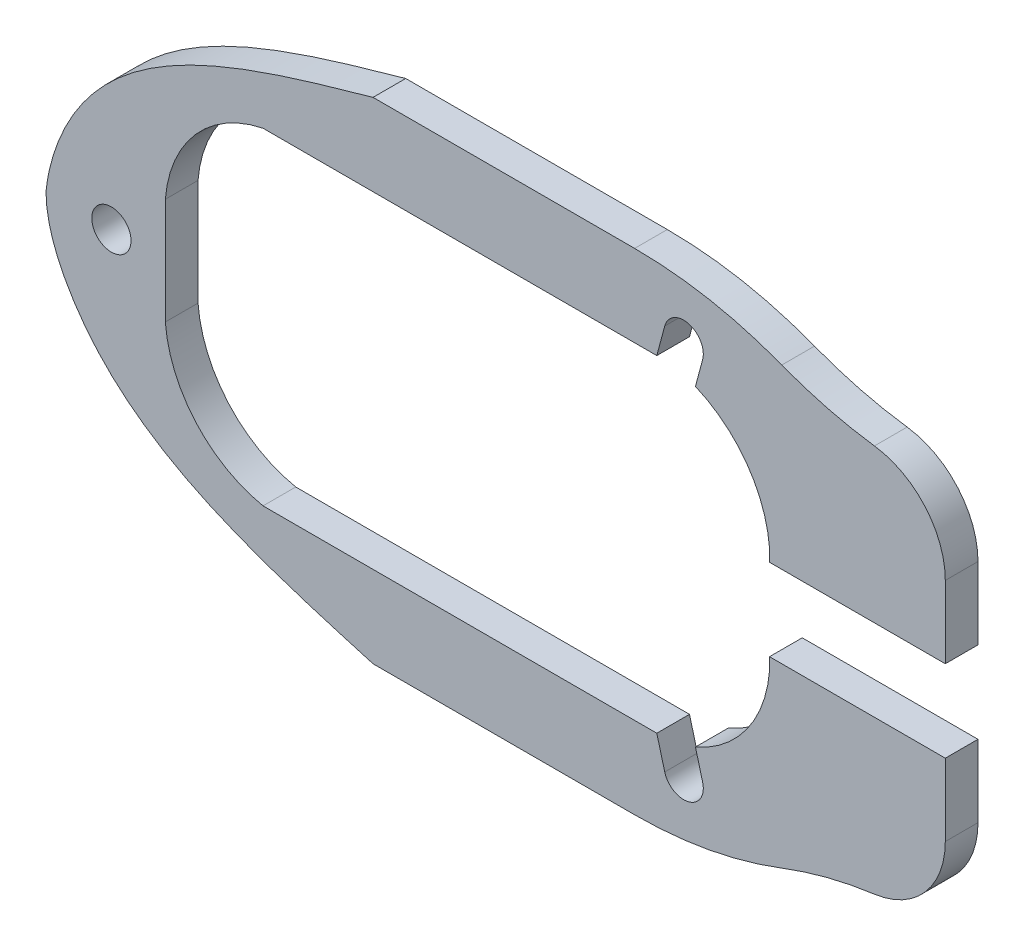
ISO-10303-21;
HEADER;
FILE_DESCRIPTION(('STEP AP214'),'2;1');
FILE_NAME('part.step','',(''),(''),'','','');
FILE_SCHEMA(('AUTOMOTIVE_DESIGN { 1 0 10303 214 1 1 1 1 }'));
ENDSEC;
DATA;
#1=APPLICATION_CONTEXT('core data for automotive mechanical design processes');
#2=APPLICATION_PROTOCOL_DEFINITION('international standard','automotive_design',2000,#1);
#3=PRODUCT_CONTEXT('',#1,'mechanical');
#4=PRODUCT('Part','Part','',(#3));
#5=PRODUCT_RELATED_PRODUCT_CATEGORY('part','',(#4));
#6=PRODUCT_DEFINITION_FORMATION('','',#4);
#7=PRODUCT_DEFINITION_CONTEXT('part definition',#1,'design');
#8=PRODUCT_DEFINITION('design','',#6,#7);
#9=PRODUCT_DEFINITION_SHAPE('','',#8);
#10=(LENGTH_UNIT() NAMED_UNIT(*) SI_UNIT(.MILLI.,.METRE.));
#11=(NAMED_UNIT(*) PLANE_ANGLE_UNIT() SI_UNIT($,.RADIAN.));
#12=(NAMED_UNIT(*) SI_UNIT($,.STERADIAN.) SOLID_ANGLE_UNIT());
#13=UNCERTAINTY_MEASURE_WITH_UNIT(LENGTH_MEASURE(1.E-05),#10,'distance_accuracy_value','');
#14=(GEOMETRIC_REPRESENTATION_CONTEXT(3) GLOBAL_UNCERTAINTY_ASSIGNED_CONTEXT((#13)) GLOBAL_UNIT_ASSIGNED_CONTEXT((#10,
#11,#12)) REPRESENTATION_CONTEXT('',''));
#15=CARTESIAN_POINT('',(0.,0.,0.));
#16=DIRECTION('',(0.,0.,1.));
#17=DIRECTION('',(1.,0.,0.));
#18=AXIS2_PLACEMENT_3D('',#15,#16,#17);
#19=CARTESIAN_POINT('',(-144.117623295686,19.4455310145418,2.));
#20=DIRECTION('',(0.,0.,-1.));
#21=DIRECTION('',(-1.,0.,0.));
#22=AXIS2_PLACEMENT_3D('',#19,#20,#21);
#23=PLANE('',#22);
#24=CARTESIAN_POINT('',(-190.117623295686,26.3610086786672,2.));
#25=DIRECTION('',(0.,0.,1.));
#26=DIRECTION('',(1.,0.,0.));
#27=AXIS2_PLACEMENT_3D('',#24,#25,#26);
#28=CIRCLE('',#27,1.20000000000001);
#29=CARTESIAN_POINT('',(-188.917623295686,26.3610086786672,2.));
#30=VERTEX_POINT('',#29);
#31=EDGE_CURVE('E263',#30,#30,#28,.T.);
#32=ORIENTED_EDGE('',*,*,#31,.F.);
#33=EDGE_LOOP('',(#32));
#34=FACE_BOUND('',#33,.T.);
#35=DIRECTION('',(0.258819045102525,-0.965925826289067,0.));
#36=VECTOR('',#35,1.);
#37=CARTESIAN_POINT('',(-156.276734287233,14.5504258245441,2.));
#38=LINE('',#37,#36);
#39=CARTESIAN_POINT('',(-156.761878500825,16.3610086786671,2.));
#40=VERTEX_POINT('',#39);
#41=CARTESIAN_POINT('',(-156.276734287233,14.5504258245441,2.));
#42=VERTEX_POINT('',#41);
#43=EDGE_CURVE('E226',#40,#42,#38,.T.);
#44=ORIENTED_EDGE('',*,*,#43,.F.);
#45=DIRECTION('',(1.,0.,0.));
#46=VECTOR('',#45,1.);
#47=CARTESIAN_POINT('',(-180.843707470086,16.3610086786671,2.));
#48=LINE('',#47,#46);
#49=CARTESIAN_POINT('',(-180.843707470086,16.3610086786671,2.));
#50=VERTEX_POINT('',#49);
#51=EDGE_CURVE('E269',#50,#40,#48,.T.);
#52=ORIENTED_EDGE('',*,*,#51,.F.);
#53=CARTESIAN_POINT('',(-179.343707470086,23.7094779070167,2.));
#54=DIRECTION('',(0.,0.,1.));
#55=DIRECTION('',(1.,0.,0.));
#56=AXIS2_PLACEMENT_3D('',#53,#54,#55);
#57=CIRCLE('',#56,7.50000000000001);
#58=CARTESIAN_POINT('',(-186.819791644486,23.1110086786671,2.));
#59=VERTEX_POINT('',#58);
#60=EDGE_CURVE('E266',#59,#50,#57,.T.);
#61=ORIENTED_EDGE('',*,*,#60,.F.);
#62=DIRECTION('',(0.,-1.,0.));
#63=VECTOR('',#62,1.);
#64=CARTESIAN_POINT('',(-186.819791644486,29.6110086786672,2.));
#65=LINE('',#64,#63);
#66=CARTESIAN_POINT('',(-186.819791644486,29.6110086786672,2.));
#67=VERTEX_POINT('',#66);
#68=EDGE_CURVE('E293',#67,#59,#65,.T.);
#69=ORIENTED_EDGE('',*,*,#68,.F.);
#70=CARTESIAN_POINT('',(-179.343707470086,29.0125394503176,2.));
#71=DIRECTION('',(0.,0.,1.));
#72=DIRECTION('',(-1.,0.,0.));
#73=AXIS2_PLACEMENT_3D('',#70,#71,#72);
#74=CIRCLE('',#73,7.50000000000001);
#75=CARTESIAN_POINT('',(-180.843707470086,36.3610086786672,2.));
#76=VERTEX_POINT('',#75);
#77=EDGE_CURVE('E290',#76,#67,#74,.T.);
#78=ORIENTED_EDGE('',*,*,#77,.F.);
#79=DIRECTION('',(-1.,0.,0.));
#80=VECTOR('',#79,1.);
#81=CARTESIAN_POINT('',(-180.843707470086,36.3610086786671,2.));
#82=LINE('',#81,#80);
#83=CARTESIAN_POINT('',(-156.761878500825,36.3610086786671,2.));
#84=VERTEX_POINT('',#83);
#85=EDGE_CURVE('E288',#84,#76,#82,.T.);
#86=ORIENTED_EDGE('',*,*,#85,.F.);
#87=DIRECTION('',(-0.258819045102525,-0.965925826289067,0.));
#88=VECTOR('',#87,1.);
#89=CARTESIAN_POINT('',(-156.276734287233,38.1715915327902,2.));
#90=LINE('',#89,#88);
#91=CARTESIAN_POINT('',(-156.276734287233,38.1715915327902,2.));
#92=VERTEX_POINT('',#91);
#93=EDGE_CURVE('E251',#92,#84,#90,.T.);
#94=ORIENTED_EDGE('',*,*,#93,.F.);
#95=CARTESIAN_POINT('',(-155.117623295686,37.8610086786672,2.));
#96=DIRECTION('',(0.,0.,1.));
#97=DIRECTION('',(1.,0.,0.));
#98=AXIS2_PLACEMENT_3D('',#95,#96,#97);
#99=CIRCLE('',#98,1.20000000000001);
#100=CARTESIAN_POINT('',(-153.958512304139,37.5504258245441,2.));
#101=VERTEX_POINT('',#100);
#102=EDGE_CURVE('E249',#101,#92,#99,.T.);
#103=ORIENTED_EDGE('',*,*,#102,.F.);
#104=DIRECTION('',(0.258819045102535,0.965925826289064,0.));
#105=VECTOR('',#104,1.);
#106=CARTESIAN_POINT('',(-154.769987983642,34.5219573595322,2.));
#107=LINE('',#106,#105);
#108=CARTESIAN_POINT('',(-154.39809415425,35.9098840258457,2.));
#109=VERTEX_POINT('',#108);
#110=EDGE_CURVE('E253',#109,#101,#107,.T.);
#111=ORIENTED_EDGE('',*,*,#110,.F.);
#112=CARTESIAN_POINT('',(-157.343707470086,29.0125394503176,2.));
#113=DIRECTION('',(0.,0.,1.));
#114=DIRECTION('',(-1.,0.,0.));
#115=AXIS2_PLACEMENT_3D('',#112,#113,#114);
#116=CIRCLE('',#115,7.49999999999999);
#117=CARTESIAN_POINT('',(-149.867623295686,29.6110086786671,2.));
#118=VERTEX_POINT('',#117);
#119=EDGE_CURVE('E285',#118,#109,#116,.T.);
#120=ORIENTED_EDGE('',*,*,#119,.F.);
#121=DIRECTION('',(0.,1.,0.));
#122=VECTOR('',#121,1.);
#123=CARTESIAN_POINT('',(-149.867623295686,29.6110086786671,2.));
#124=LINE('',#123,#122);
#125=CARTESIAN_POINT('',(-149.867623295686,28.8610086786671,2.));
#126=VERTEX_POINT('',#125);
#127=EDGE_CURVE('E282',#126,#118,#124,.T.);
#128=ORIENTED_EDGE('',*,*,#127,.F.);
#129=DIRECTION('',(-1.,0.,0.));
#130=VECTOR('',#129,1.);
#131=CARTESIAN_POINT('',(-149.867623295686,28.8610086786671,2.));
#132=LINE('',#131,#130);
#133=CARTESIAN_POINT('',(-139.117623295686,28.8610086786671,2.));
#134=VERTEX_POINT('',#133);
#135=EDGE_CURVE('E279',#134,#126,#132,.T.);
#136=ORIENTED_EDGE('',*,*,#135,.F.);
#137=DIRECTION('',(0.,1.,0.));
#138=VECTOR('',#137,1.);
#139=CARTESIAN_POINT('',(-139.117623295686,33.2764863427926,2.));
#140=LINE('',#139,#138);
#141=CARTESIAN_POINT('',(-139.117623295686,33.2764863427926,2.));
#142=VERTEX_POINT('',#141);
#143=EDGE_CURVE('E385',#134,#142,#140,.T.);
#144=ORIENTED_EDGE('',*,*,#143,.T.);
#145=CARTESIAN_POINT('',(-144.117623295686,33.2764863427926,2.));
#146=DIRECTION('',(0.,0.,1.));
#147=DIRECTION('',(-1.,0.,0.));
#148=AXIS2_PLACEMENT_3D('',#145,#146,#147);
#149=CIRCLE('',#148,5.);
#150=CARTESIAN_POINT('',(-143.450956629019,38.2318425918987,2.));
#151=VERTEX_POINT('',#150);
#152=EDGE_CURVE('E389',#142,#151,#149,.T.);
#153=ORIENTED_EDGE('',*,*,#152,.T.);
#154=CARTESIAN_POINT('',(-140.117623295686,63.0086238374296,2.));
#155=DIRECTION('',(0.,0.,-1.));
#156=DIRECTION('',(-1.,0.,0.));
#157=AXIS2_PLACEMENT_3D('',#154,#155,#156);
#158=CIRCLE('',#157,25.);
#159=CARTESIAN_POINT('',(-149.117623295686,39.6848162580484,2.));
#160=VERTEX_POINT('',#159);
#161=EDGE_CURVE('E391',#151,#160,#158,.T.);
#162=ORIENTED_EDGE('',*,*,#161,.T.);
#163=CARTESIAN_POINT('',(-158.117623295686,16.3610086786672,2.));
#164=DIRECTION('',(0.,0.,1.));
#165=DIRECTION('',(1.,0.,0.));
#166=AXIS2_PLACEMENT_3D('',#163,#164,#165);
#167=CIRCLE('',#166,25.);
#168=CARTESIAN_POINT('',(-158.117623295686,41.3610086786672,2.));
#169=VERTEX_POINT('',#168);
#170=EDGE_CURVE('E393',#160,#169,#167,.T.);
#171=ORIENTED_EDGE('',*,*,#170,.T.);
#172=DIRECTION('',(-1.,0.,0.));
#173=VECTOR('',#172,1.);
#174=CARTESIAN_POINT('',(-174.117623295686,41.3610086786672,2.));
#175=LINE('',#174,#173);
#176=CARTESIAN_POINT('',(-174.117623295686,41.3610086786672,2.));
#177=VERTEX_POINT('',#176);
#178=EDGE_CURVE('E395',#169,#177,#175,.T.);
#179=ORIENTED_EDGE('',*,*,#178,.T.);
#180=CARTESIAN_POINT('',(-174.117623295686,41.3610086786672,2.));
#181=CARTESIAN_POINT('',(-181.70516900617,39.2157054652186,2.));
#182=CARTESIAN_POINT('',(-190.998119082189,36.588216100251,2.));
#183=CARTESIAN_POINT('',(-193.959232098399,27.9475153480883,2.));
#184=CARTESIAN_POINT('',(-194.117623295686,26.3610086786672,2.));
#185=B_SPLINE_CURVE_WITH_KNOTS('',3,(#180,#181,#182,#183,#184),.UNSPECIFIED.,.F.,.F.,(4,1,4),
(0.,0.816484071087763,1.),.UNSPECIFIED.);
#186=CARTESIAN_POINT('',(-194.117623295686,26.3610086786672,2.));
#187=VERTEX_POINT('',#186);
#188=EDGE_CURVE('E397',#177,#187,#185,.T.);
#189=ORIENTED_EDGE('',*,*,#188,.T.);
#190=CARTESIAN_POINT('',(-194.117623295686,26.3610086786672,2.));
#191=CARTESIAN_POINT('',(-194.117623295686,24.7666150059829,2.));
#192=CARTESIAN_POINT('',(-190.662711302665,16.1505027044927,2.));
#193=CARTESIAN_POINT('',(-181.554407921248,13.513818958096,2.));
#194=CARTESIAN_POINT('',(-174.117623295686,11.3610086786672,2.));
#195=B_SPLINE_CURVE_WITH_KNOTS('',3,(#190,#191,#192,#193,#194),.UNSPECIFIED.,.F.,.F.,(4,1,4),
(0.,0.183515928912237,1.),.UNSPECIFIED.);
#196=CARTESIAN_POINT('',(-174.117623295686,11.3610086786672,2.));
#197=VERTEX_POINT('',#196);
#198=EDGE_CURVE('E402',#187,#197,#195,.T.);
#199=ORIENTED_EDGE('',*,*,#198,.T.);
#200=DIRECTION('',(1.,0.,0.));
#201=VECTOR('',#200,1.);
#202=CARTESIAN_POINT('',(-174.117623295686,11.3610086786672,2.));
#203=LINE('',#202,#201);
#204=CARTESIAN_POINT('',(-158.117623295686,11.3610086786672,2.));
#205=VERTEX_POINT('',#204);
#206=EDGE_CURVE('E590',#197,#205,#203,.T.);
#207=ORIENTED_EDGE('',*,*,#206,.T.);
#208=CARTESIAN_POINT('',(-158.117623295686,36.3610086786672,2.));
#209=DIRECTION('',(0.,0.,1.));
#210=DIRECTION('',(-1.,0.,0.));
#211=AXIS2_PLACEMENT_3D('',#208,#209,#210);
#212=CIRCLE('',#211,25.);
#213=CARTESIAN_POINT('',(-149.117623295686,13.037201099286,2.));
#214=VERTEX_POINT('',#213);
#215=EDGE_CURVE('E486',#205,#214,#212,.T.);
#216=ORIENTED_EDGE('',*,*,#215,.T.);
#217=CARTESIAN_POINT('',(-140.117623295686,-10.2866064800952,2.));
#218=DIRECTION('',(0.,0.,-1.));
#219=DIRECTION('',(1.,0.,0.));
#220=AXIS2_PLACEMENT_3D('',#217,#218,#219);
#221=CIRCLE('',#220,25.);
#222=CARTESIAN_POINT('',(-143.450956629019,14.4901747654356,2.));
#223=VERTEX_POINT('',#222);
#224=EDGE_CURVE('E497',#214,#223,#221,.T.);
#225=ORIENTED_EDGE('',*,*,#224,.T.);
#226=CARTESIAN_POINT('',(-144.117623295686,19.4455310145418,2.));
#227=DIRECTION('',(0.,0.,1.));
#228=DIRECTION('',(-1.,0.,0.));
#229=AXIS2_PLACEMENT_3D('',#226,#227,#228);
#230=CIRCLE('',#229,4.99999999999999);
#231=CARTESIAN_POINT('',(-139.117623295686,19.4455310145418,2.));
#232=VERTEX_POINT('',#231);
#233=EDGE_CURVE('E382',#223,#232,#230,.T.);
#234=ORIENTED_EDGE('',*,*,#233,.T.);
#235=CARTESIAN_POINT('',(-139.117623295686,23.8610086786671,2.));
#236=VERTEX_POINT('',#235);
#237=EDGE_CURVE('E386',#232,#236,#140,.T.);
#238=ORIENTED_EDGE('',*,*,#237,.T.);
#239=DIRECTION('',(1.,0.,0.));
#240=VECTOR('',#239,1.);
#241=CARTESIAN_POINT('',(-149.867623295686,23.8610086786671,2.));
#242=LINE('',#241,#240);
#243=CARTESIAN_POINT('',(-149.867623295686,23.8610086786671,2.));
#244=VERTEX_POINT('',#243);
#245=EDGE_CURVE('E277',#244,#236,#242,.T.);
#246=ORIENTED_EDGE('',*,*,#245,.F.);
#247=DIRECTION('',(0.,1.,0.));
#248=VECTOR('',#247,1.);
#249=CARTESIAN_POINT('',(-149.867623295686,23.8610086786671,2.));
#250=LINE('',#249,#248);
#251=CARTESIAN_POINT('',(-149.867623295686,23.1110086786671,2.));
#252=VERTEX_POINT('',#251);
#253=EDGE_CURVE('E274',#252,#244,#250,.T.);
#254=ORIENTED_EDGE('',*,*,#253,.F.);
#255=CARTESIAN_POINT('',(-157.343707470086,23.7094779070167,2.));
#256=DIRECTION('',(0.,0.,1.));
#257=DIRECTION('',(1.,0.,0.));
#258=AXIS2_PLACEMENT_3D('',#255,#256,#257);
#259=CIRCLE('',#258,7.49999999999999);
#260=CARTESIAN_POINT('',(-154.39809415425,16.8121333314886,2.));
#261=VERTEX_POINT('',#260);
#262=EDGE_CURVE('E272',#261,#252,#259,.T.);
#263=ORIENTED_EDGE('',*,*,#262,.F.);
#264=DIRECTION('',(-0.258819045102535,0.965925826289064,0.));
#265=VECTOR('',#264,1.);
#266=CARTESIAN_POINT('',(-154.769987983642,18.2000599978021,2.));
#267=LINE('',#266,#265);
#268=CARTESIAN_POINT('',(-153.958512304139,15.1715915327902,2.));
#269=VERTEX_POINT('',#268);
#270=EDGE_CURVE('E240',#269,#261,#267,.T.);
#271=ORIENTED_EDGE('',*,*,#270,.F.);
#272=CARTESIAN_POINT('',(-155.117623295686,14.8610086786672,2.));
#273=DIRECTION('',(0.,0.,1.));
#274=DIRECTION('',(-1.,0.,0.));
#275=AXIS2_PLACEMENT_3D('',#272,#273,#274);
#276=CIRCLE('',#275,1.20000000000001);
#277=EDGE_CURVE('E238',#42,#269,#276,.T.);
#278=ORIENTED_EDGE('',*,*,#277,.F.);
#279=EDGE_LOOP('',(#44,#52,#61,#69,#78,#86,#94,#103,#111,#120,#128,#136,#144,#153,#162,#171,
#179,#189,#199,#207,#216,#225,#234,#238,#246,#254,#263,#271,#278));
#280=FACE_BOUND('',#279,.T.);
#281=ADVANCED_FACE('F22',(#34,#280),#23,.F.);
#282=CARTESIAN_POINT('',(-144.117623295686,19.4455310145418,0.));
#283=DIRECTION('',(0.,0.,-1.));
#284=DIRECTION('',(-1.,0.,0.));
#285=AXIS2_PLACEMENT_3D('',#282,#283,#284);
#286=PLANE('',#285);
#287=CARTESIAN_POINT('',(-190.117623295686,26.3610086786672,0.));
#288=DIRECTION('',(0.,0.,1.));
#289=DIRECTION('',(1.,0.,0.));
#290=AXIS2_PLACEMENT_3D('',#287,#288,#289);
#291=CIRCLE('',#290,1.20000000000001);
#292=CARTESIAN_POINT('',(-188.917623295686,26.3610086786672,0.));
#293=VERTEX_POINT('',#292);
#294=EDGE_CURVE('E260',#293,#293,#291,.T.);
#295=ORIENTED_EDGE('',*,*,#294,.T.);
#296=EDGE_LOOP('',(#295));
#297=FACE_BOUND('',#296,.T.);
#298=DIRECTION('',(1.,0.,0.));
#299=VECTOR('',#298,1.);
#300=CARTESIAN_POINT('',(-180.843707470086,16.3610086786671,0.));
#301=LINE('',#300,#299);
#302=CARTESIAN_POINT('',(-180.843707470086,16.3610086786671,0.));
#303=VERTEX_POINT('',#302);
#304=CARTESIAN_POINT('',(-156.761878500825,16.3610086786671,0.));
#305=VERTEX_POINT('',#304);
#306=EDGE_CURVE('E233',#303,#305,#301,.T.);
#307=ORIENTED_EDGE('',*,*,#306,.T.);
#308=DIRECTION('',(0.258819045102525,-0.965925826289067,0.));
#309=VECTOR('',#308,1.);
#310=CARTESIAN_POINT('',(-156.276734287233,14.5504258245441,0.));
#311=LINE('',#310,#309);
#312=CARTESIAN_POINT('',(-156.276734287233,14.5504258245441,0.));
#313=VERTEX_POINT('',#312);
#314=EDGE_CURVE('E37',#305,#313,#311,.T.);
#315=ORIENTED_EDGE('',*,*,#314,.T.);
#316=CARTESIAN_POINT('',(-155.117623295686,14.8610086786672,0.));
#317=DIRECTION('',(0.,0.,1.));
#318=DIRECTION('',(-1.,0.,0.));
#319=AXIS2_PLACEMENT_3D('',#316,#317,#318);
#320=CIRCLE('',#319,1.20000000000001);
#321=CARTESIAN_POINT('',(-153.958512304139,15.1715915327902,0.));
#322=VERTEX_POINT('',#321);
#323=EDGE_CURVE('E213',#313,#322,#320,.T.);
#324=ORIENTED_EDGE('',*,*,#323,.T.);
#325=DIRECTION('',(-0.258819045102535,0.965925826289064,0.));
#326=VECTOR('',#325,1.);
#327=CARTESIAN_POINT('',(-154.769987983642,18.2000599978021,0.));
#328=LINE('',#327,#326);
#329=CARTESIAN_POINT('',(-154.39809415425,16.8121333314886,0.));
#330=VERTEX_POINT('',#329);
#331=EDGE_CURVE('E222',#322,#330,#328,.T.);
#332=ORIENTED_EDGE('',*,*,#331,.T.);
#333=CARTESIAN_POINT('',(-157.343707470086,23.7094779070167,0.));
#334=DIRECTION('',(0.,0.,1.));
#335=DIRECTION('',(1.,0.,0.));
#336=AXIS2_PLACEMENT_3D('',#333,#334,#335);
#337=CIRCLE('',#336,7.49999999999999);
#338=CARTESIAN_POINT('',(-149.867623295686,23.1110086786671,0.));
#339=VERTEX_POINT('',#338);
#340=EDGE_CURVE('E299',#330,#339,#337,.T.);
#341=ORIENTED_EDGE('',*,*,#340,.T.);
#342=DIRECTION('',(0.,1.,0.));
#343=VECTOR('',#342,1.);
#344=CARTESIAN_POINT('',(-149.867623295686,23.8610086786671,0.));
#345=LINE('',#344,#343);
#346=CARTESIAN_POINT('',(-149.867623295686,23.8610086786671,0.));
#347=VERTEX_POINT('',#346);
#348=EDGE_CURVE('E301',#339,#347,#345,.T.);
#349=ORIENTED_EDGE('',*,*,#348,.T.);
#350=DIRECTION('',(1.,0.,0.));
#351=VECTOR('',#350,1.);
#352=CARTESIAN_POINT('',(-149.867623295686,23.8610086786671,0.));
#353=LINE('',#352,#351);
#354=CARTESIAN_POINT('',(-139.117623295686,23.8610086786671,0.));
#355=VERTEX_POINT('',#354);
#356=EDGE_CURVE('E304',#347,#355,#353,.T.);
#357=ORIENTED_EDGE('',*,*,#356,.T.);
#358=DIRECTION('',(0.,1.,0.));
#359=VECTOR('',#358,1.);
#360=CARTESIAN_POINT('',(-139.117623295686,33.2764863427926,0.));
#361=LINE('',#360,#359);
#362=CARTESIAN_POINT('',(-139.117623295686,19.4455310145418,0.));
#363=VERTEX_POINT('',#362);
#364=EDGE_CURVE('E351',#363,#355,#361,.T.);
#365=ORIENTED_EDGE('',*,*,#364,.F.);
#366=CARTESIAN_POINT('',(-144.117623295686,19.4455310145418,0.));
#367=DIRECTION('',(0.,0.,1.));
#368=DIRECTION('',(-1.,0.,0.));
#369=AXIS2_PLACEMENT_3D('',#366,#367,#368);
#370=CIRCLE('',#369,4.99999999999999);
#371=CARTESIAN_POINT('',(-143.450956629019,14.4901747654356,0.));
#372=VERTEX_POINT('',#371);
#373=EDGE_CURVE('E327',#372,#363,#370,.T.);
#374=ORIENTED_EDGE('',*,*,#373,.F.);
#375=CARTESIAN_POINT('',(-140.117623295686,-10.2866064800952,0.));
#376=DIRECTION('',(0.,0.,-1.));
#377=DIRECTION('',(1.,0.,0.));
#378=AXIS2_PLACEMENT_3D('',#375,#376,#377);
#379=CIRCLE('',#378,25.);
#380=CARTESIAN_POINT('',(-149.117623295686,13.037201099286,0.));
#381=VERTEX_POINT('',#380);
#382=EDGE_CURVE('E380',#381,#372,#379,.T.);
#383=ORIENTED_EDGE('',*,*,#382,.F.);
#384=CARTESIAN_POINT('',(-158.117623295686,36.3610086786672,0.));
#385=DIRECTION('',(0.,0.,1.));
#386=DIRECTION('',(-1.,0.,0.));
#387=AXIS2_PLACEMENT_3D('',#384,#385,#386);
#388=CIRCLE('',#387,25.);
#389=CARTESIAN_POINT('',(-158.117623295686,11.3610086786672,0.));
#390=VERTEX_POINT('',#389);
#391=EDGE_CURVE('E378',#390,#381,#388,.T.);
#392=ORIENTED_EDGE('',*,*,#391,.F.);
#393=DIRECTION('',(1.,0.,0.));
#394=VECTOR('',#393,1.);
#395=CARTESIAN_POINT('',(-174.117623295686,11.3610086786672,0.));
#396=LINE('',#395,#394);
#397=CARTESIAN_POINT('',(-174.117623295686,11.3610086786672,0.));
#398=VERTEX_POINT('',#397);
#399=EDGE_CURVE('E373',#398,#390,#396,.T.);
#400=ORIENTED_EDGE('',*,*,#399,.F.);
#401=CARTESIAN_POINT('',(-194.117623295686,26.3610086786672,0.));
#402=CARTESIAN_POINT('',(-194.117623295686,24.7666150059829,0.));
#403=CARTESIAN_POINT('',(-190.662711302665,16.1505027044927,0.));
#404=CARTESIAN_POINT('',(-181.554407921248,13.513818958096,0.));
#405=CARTESIAN_POINT('',(-174.117623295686,11.3610086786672,0.));
#406=B_SPLINE_CURVE_WITH_KNOTS('',3,(#401,#402,#403,#404,#405),.UNSPECIFIED.,.F.,.F.,(4,1,4),
(0.,0.183515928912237,1.),.UNSPECIFIED.);
#407=CARTESIAN_POINT('',(-194.117623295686,26.3610086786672,0.));
#408=VERTEX_POINT('',#407);
#409=EDGE_CURVE('E366',#408,#398,#406,.T.);
#410=ORIENTED_EDGE('',*,*,#409,.F.);
#411=CARTESIAN_POINT('',(-174.117623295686,41.3610086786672,0.));
#412=CARTESIAN_POINT('',(-181.70516900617,39.2157054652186,0.));
#413=CARTESIAN_POINT('',(-190.998119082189,36.588216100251,0.));
#414=CARTESIAN_POINT('',(-193.959232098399,27.9475153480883,0.));
#415=CARTESIAN_POINT('',(-194.117623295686,26.3610086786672,0.));
#416=B_SPLINE_CURVE_WITH_KNOTS('',3,(#411,#412,#413,#414,#415),.UNSPECIFIED.,.F.,.F.,(4,1,4),
(0.,0.816484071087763,1.),.UNSPECIFIED.);
#417=CARTESIAN_POINT('',(-174.117623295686,41.3610086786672,0.));
#418=VERTEX_POINT('',#417);
#419=EDGE_CURVE('E362',#418,#408,#416,.T.);
#420=ORIENTED_EDGE('',*,*,#419,.F.);
#421=DIRECTION('',(-1.,0.,0.));
#422=VECTOR('',#421,1.);
#423=CARTESIAN_POINT('',(-174.117623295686,41.3610086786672,0.));
#424=LINE('',#423,#422);
#425=CARTESIAN_POINT('',(-158.117623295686,41.3610086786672,0.));
#426=VERTEX_POINT('',#425);
#427=EDGE_CURVE('E360',#426,#418,#424,.T.);
#428=ORIENTED_EDGE('',*,*,#427,.F.);
#429=CARTESIAN_POINT('',(-158.117623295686,16.3610086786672,0.));
#430=DIRECTION('',(0.,0.,1.));
#431=DIRECTION('',(1.,0.,0.));
#432=AXIS2_PLACEMENT_3D('',#429,#430,#431);
#433=CIRCLE('',#432,25.);
#434=CARTESIAN_POINT('',(-149.117623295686,39.6848162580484,0.));
#435=VERTEX_POINT('',#434);
#436=EDGE_CURVE('E358',#435,#426,#433,.T.);
#437=ORIENTED_EDGE('',*,*,#436,.F.);
#438=CARTESIAN_POINT('',(-140.117623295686,63.0086238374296,0.));
#439=DIRECTION('',(0.,0.,-1.));
#440=DIRECTION('',(-1.,0.,0.));
#441=AXIS2_PLACEMENT_3D('',#438,#439,#440);
#442=CIRCLE('',#441,25.);
#443=CARTESIAN_POINT('',(-143.450956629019,38.2318425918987,0.));
#444=VERTEX_POINT('',#443);
#445=EDGE_CURVE('E356',#444,#435,#442,.T.);
#446=ORIENTED_EDGE('',*,*,#445,.F.);
#447=CARTESIAN_POINT('',(-144.117623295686,33.2764863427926,0.));
#448=DIRECTION('',(0.,0.,1.));
#449=DIRECTION('',(-1.,0.,0.));
#450=AXIS2_PLACEMENT_3D('',#447,#448,#449);
#451=CIRCLE('',#450,5.);
#452=CARTESIAN_POINT('',(-139.117623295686,33.2764863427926,0.));
#453=VERTEX_POINT('',#452);
#454=EDGE_CURVE('E354',#453,#444,#451,.T.);
#455=ORIENTED_EDGE('',*,*,#454,.F.);
#456=CARTESIAN_POINT('',(-139.117623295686,28.8610086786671,0.));
#457=VERTEX_POINT('',#456);
#458=EDGE_CURVE('E350',#457,#453,#361,.T.);
#459=ORIENTED_EDGE('',*,*,#458,.F.);
#460=DIRECTION('',(-1.,0.,0.));
#461=VECTOR('',#460,1.);
#462=CARTESIAN_POINT('',(-149.867623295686,28.8610086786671,0.));
#463=LINE('',#462,#461);
#464=CARTESIAN_POINT('',(-149.867623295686,28.8610086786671,0.));
#465=VERTEX_POINT('',#464);
#466=EDGE_CURVE('E307',#457,#465,#463,.T.);
#467=ORIENTED_EDGE('',*,*,#466,.T.);
#468=DIRECTION('',(0.,1.,0.));
#469=VECTOR('',#468,1.);
#470=CARTESIAN_POINT('',(-149.867623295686,29.6110086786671,0.));
#471=LINE('',#470,#469);
#472=CARTESIAN_POINT('',(-149.867623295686,29.6110086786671,0.));
#473=VERTEX_POINT('',#472);
#474=EDGE_CURVE('E310',#465,#473,#471,.T.);
#475=ORIENTED_EDGE('',*,*,#474,.T.);
#476=CARTESIAN_POINT('',(-157.343707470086,29.0125394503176,0.));
#477=DIRECTION('',(0.,0.,1.));
#478=DIRECTION('',(-1.,0.,0.));
#479=AXIS2_PLACEMENT_3D('',#476,#477,#478);
#480=CIRCLE('',#479,7.49999999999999);
#481=CARTESIAN_POINT('',(-154.39809415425,35.9098840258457,0.));
#482=VERTEX_POINT('',#481);
#483=EDGE_CURVE('E313',#473,#482,#480,.T.);
#484=ORIENTED_EDGE('',*,*,#483,.T.);
#485=DIRECTION('',(0.258819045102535,0.965925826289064,0.));
#486=VECTOR('',#485,1.);
#487=CARTESIAN_POINT('',(-154.769987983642,34.5219573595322,0.));
#488=LINE('',#487,#486);
#489=CARTESIAN_POINT('',(-153.958512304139,37.5504258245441,0.));
#490=VERTEX_POINT('',#489);
#491=EDGE_CURVE('E45',#482,#490,#488,.T.);
#492=ORIENTED_EDGE('',*,*,#491,.T.);
#493=CARTESIAN_POINT('',(-155.117623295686,37.8610086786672,0.));
#494=DIRECTION('',(0.,0.,1.));
#495=DIRECTION('',(1.,0.,0.));
#496=AXIS2_PLACEMENT_3D('',#493,#494,#495);
#497=CIRCLE('',#496,1.20000000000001);
#498=CARTESIAN_POINT('',(-156.276734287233,38.1715915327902,0.));
#499=VERTEX_POINT('',#498);
#500=EDGE_CURVE('E227',#490,#499,#497,.T.);
#501=ORIENTED_EDGE('',*,*,#500,.T.);
#502=DIRECTION('',(-0.258819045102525,-0.965925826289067,0.));
#503=VECTOR('',#502,1.);
#504=CARTESIAN_POINT('',(-156.276734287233,38.1715915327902,0.));
#505=LINE('',#504,#503);
#506=CARTESIAN_POINT('',(-156.761878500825,36.3610086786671,0.));
#507=VERTEX_POINT('',#506);
#508=EDGE_CURVE('E245',#499,#507,#505,.T.);
#509=ORIENTED_EDGE('',*,*,#508,.T.);
#510=DIRECTION('',(-1.,0.,0.));
#511=VECTOR('',#510,1.);
#512=CARTESIAN_POINT('',(-180.843707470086,36.3610086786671,0.));
#513=LINE('',#512,#511);
#514=CARTESIAN_POINT('',(-180.843707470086,36.3610086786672,0.));
#515=VERTEX_POINT('',#514);
#516=EDGE_CURVE('E316',#507,#515,#513,.T.);
#517=ORIENTED_EDGE('',*,*,#516,.T.);
#518=CARTESIAN_POINT('',(-179.343707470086,29.0125394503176,0.));
#519=DIRECTION('',(0.,0.,1.));
#520=DIRECTION('',(-1.,0.,0.));
#521=AXIS2_PLACEMENT_3D('',#518,#519,#520);
#522=CIRCLE('',#521,7.50000000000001);
#523=CARTESIAN_POINT('',(-186.819791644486,29.6110086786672,0.));
#524=VERTEX_POINT('',#523);
#525=EDGE_CURVE('E318',#515,#524,#522,.T.);
#526=ORIENTED_EDGE('',*,*,#525,.T.);
#527=DIRECTION('',(0.,-1.,0.));
#528=VECTOR('',#527,1.);
#529=CARTESIAN_POINT('',(-186.819791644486,29.6110086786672,0.));
#530=LINE('',#529,#528);
#531=CARTESIAN_POINT('',(-186.819791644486,23.1110086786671,0.));
#532=VERTEX_POINT('',#531);
#533=EDGE_CURVE('E321',#524,#532,#530,.T.);
#534=ORIENTED_EDGE('',*,*,#533,.T.);
#535=CARTESIAN_POINT('',(-179.343707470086,23.7094779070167,0.));
#536=DIRECTION('',(0.,0.,1.));
#537=DIRECTION('',(1.,0.,0.));
#538=AXIS2_PLACEMENT_3D('',#535,#536,#537);
#539=CIRCLE('',#538,7.50000000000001);
#540=EDGE_CURVE('E296',#532,#303,#539,.T.);
#541=ORIENTED_EDGE('',*,*,#540,.T.);
#542=EDGE_LOOP('',(#307,#315,#324,#332,#341,#349,#357,#365,#374,#383,#392,#400,#410,#420,#428,
#437,#446,#455,#459,#467,#475,#484,#492,#501,#509,#517,#526,#534,#541));
#543=FACE_BOUND('',#542,.T.);
#544=ADVANCED_FACE('F230',(#297,#543),#286,.T.);
#545=CARTESIAN_POINT('',(-157.343707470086,23.7094779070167,0.));
#546=DIRECTION('',(0.,0.,1.));
#547=DIRECTION('',(1.,0.,0.));
#548=AXIS2_PLACEMENT_3D('',#545,#546,#547);
#549=CYLINDRICAL_SURFACE('',#548,7.49999999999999);
#550=DIRECTION('',(0.,0.,1.));
#551=VECTOR('',#550,1.);
#552=CARTESIAN_POINT('',(-154.39809415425,16.8121333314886,0.));
#553=LINE('',#552,#551);
#554=EDGE_CURVE('E11',#261,#330,#553,.F.);
#555=ORIENTED_EDGE('',*,*,#554,.F.);
#556=ORIENTED_EDGE('',*,*,#262,.T.);
#557=DIRECTION('',(0.,0.,1.));
#558=VECTOR('',#557,1.);
#559=CARTESIAN_POINT('',(-149.867623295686,23.1110086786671,0.));
#560=LINE('',#559,#558);
#561=EDGE_CURVE('E344',#339,#252,#560,.T.);
#562=ORIENTED_EDGE('',*,*,#561,.F.);
#563=ORIENTED_EDGE('',*,*,#340,.F.);
#564=EDGE_LOOP('',(#555,#556,#562,#563));
#565=FACE_BOUND('',#564,.T.);
#566=ADVANCED_FACE('F451',(#565),#549,.F.);
#567=CARTESIAN_POINT('',(-180.843707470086,16.3610086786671,0.));
#568=DIRECTION('',(0.,-1.,0.));
#569=DIRECTION('',(0.,0.,-1.));
#570=AXIS2_PLACEMENT_3D('',#567,#568,#569);
#571=PLANE('',#570);
#572=DIRECTION('',(0.,0.,1.));
#573=VECTOR('',#572,1.);
#574=CARTESIAN_POINT('',(-156.761878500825,16.3610086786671,0.));
#575=LINE('',#574,#573);
#576=EDGE_CURVE('E30',#305,#40,#575,.T.);
#577=ORIENTED_EDGE('',*,*,#576,.F.);
#578=ORIENTED_EDGE('',*,*,#306,.F.);
#579=DIRECTION('',(0.,0.,1.));
#580=VECTOR('',#579,1.);
#581=CARTESIAN_POINT('',(-180.843707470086,16.3610086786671,0.));
#582=LINE('',#581,#580);
#583=EDGE_CURVE('E324',#303,#50,#582,.T.);
#584=ORIENTED_EDGE('',*,*,#583,.T.);
#585=ORIENTED_EDGE('',*,*,#51,.T.);
#586=EDGE_LOOP('',(#577,#578,#584,#585));
#587=FACE_BOUND('',#586,.T.);
#588=ADVANCED_FACE('F532',(#587),#571,.F.);
#589=CARTESIAN_POINT('',(-180.843707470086,36.3610086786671,0.));
#590=DIRECTION('',(0.,1.,0.));
#591=DIRECTION('',(0.,0.,1.));
#592=AXIS2_PLACEMENT_3D('',#589,#590,#591);
#593=PLANE('',#592);
#594=DIRECTION('',(0.,0.,-1.));
#595=VECTOR('',#594,1.);
#596=CARTESIAN_POINT('',(-156.761878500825,36.3610086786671,0.));
#597=LINE('',#596,#595);
#598=EDGE_CURVE('E527',#84,#507,#597,.T.);
#599=ORIENTED_EDGE('',*,*,#598,.F.);
#600=ORIENTED_EDGE('',*,*,#85,.T.);
#601=DIRECTION('',(0.,0.,1.));
#602=VECTOR('',#601,1.);
#603=CARTESIAN_POINT('',(-180.843707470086,36.3610086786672,0.));
#604=LINE('',#603,#602);
#605=EDGE_CURVE('E330',#515,#76,#604,.T.);
#606=ORIENTED_EDGE('',*,*,#605,.F.);
#607=ORIENTED_EDGE('',*,*,#516,.F.);
#608=EDGE_LOOP('',(#599,#600,#606,#607));
#609=FACE_BOUND('',#608,.T.);
#610=ADVANCED_FACE('F548',(#609),#593,.F.);
#611=CARTESIAN_POINT('',(-157.343707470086,29.0125394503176,0.));
#612=DIRECTION('',(0.,0.,1.));
#613=DIRECTION('',(1.,0.,0.));
#614=AXIS2_PLACEMENT_3D('',#611,#612,#613);
#615=CYLINDRICAL_SURFACE('',#614,7.49999999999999);
#616=DIRECTION('',(0.,0.,1.));
#617=VECTOR('',#616,1.);
#618=CARTESIAN_POINT('',(-154.39809415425,35.9098840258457,0.));
#619=LINE('',#618,#617);
#620=EDGE_CURVE('E525',#482,#109,#619,.T.);
#621=ORIENTED_EDGE('',*,*,#620,.F.);
#622=ORIENTED_EDGE('',*,*,#483,.F.);
#623=DIRECTION('',(0.,0.,1.));
#624=VECTOR('',#623,1.);
#625=CARTESIAN_POINT('',(-149.867623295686,29.6110086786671,0.));
#626=LINE('',#625,#624);
#627=EDGE_CURVE('E333',#473,#118,#626,.T.);
#628=ORIENTED_EDGE('',*,*,#627,.T.);
#629=ORIENTED_EDGE('',*,*,#119,.T.);
#630=EDGE_LOOP('',(#621,#622,#628,#629));
#631=FACE_BOUND('',#630,.T.);
#632=ADVANCED_FACE('F442',(#631),#615,.F.);
#633=CARTESIAN_POINT('',(-139.117623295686,33.2764863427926,2.));
#634=DIRECTION('',(-1.,0.,0.));
#635=DIRECTION('',(0.,-1.,0.));
#636=AXIS2_PLACEMENT_3D('',#633,#634,#635);
#637=PLANE('',#636);
#638=ORIENTED_EDGE('',*,*,#143,.F.);
#639=DIRECTION('',(0.,0.,1.));
#640=VECTOR('',#639,1.);
#641=CARTESIAN_POINT('',(-139.117623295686,28.8610086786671,0.));
#642=LINE('',#641,#640);
#643=EDGE_CURVE('E337',#457,#134,#642,.T.);
#644=ORIENTED_EDGE('',*,*,#643,.F.);
#645=ORIENTED_EDGE('',*,*,#458,.T.);
#646=DIRECTION('',(0.,0.,-1.));
#647=VECTOR('',#646,1.);
#648=CARTESIAN_POINT('',(-139.117623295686,33.2764863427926,2.));
#649=LINE('',#648,#647);
#650=EDGE_CURVE('E519',#142,#453,#649,.T.);
#651=ORIENTED_EDGE('',*,*,#650,.F.);
#652=EDGE_LOOP('',(#638,#644,#645,#651));
#653=FACE_BOUND('',#652,.T.);
#654=ADVANCED_FACE('F436',(#653),#637,.F.);
#655=CARTESIAN_POINT('',(-144.117623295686,19.4455310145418,2.));
#656=DIRECTION('',(0.,0.,-1.));
#657=DIRECTION('',(-1.,0.,0.));
#658=AXIS2_PLACEMENT_3D('',#655,#656,#657);
#659=CYLINDRICAL_SURFACE('',#658,4.99999999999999);
#660=ORIENTED_EDGE('',*,*,#373,.T.);
#661=DIRECTION('',(0.,0.,-1.));
#662=VECTOR('',#661,1.);
#663=CARTESIAN_POINT('',(-139.117623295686,19.4455310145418,2.));
#664=LINE('',#663,#662);
#665=EDGE_CURVE('E522',#232,#363,#664,.T.);
#666=ORIENTED_EDGE('',*,*,#665,.F.);
#667=ORIENTED_EDGE('',*,*,#233,.F.);
#668=DIRECTION('',(0.,0.,-1.));
#669=VECTOR('',#668,1.);
#670=CARTESIAN_POINT('',(-143.450956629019,14.4901747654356,2.));
#671=LINE('',#670,#669);
#672=EDGE_CURVE('E494',#223,#372,#671,.T.);
#673=ORIENTED_EDGE('',*,*,#672,.T.);
#674=EDGE_LOOP('',(#660,#666,#667,#673));
#675=FACE_BOUND('',#674,.T.);
#676=ADVANCED_FACE('F24',(#675),#659,.T.);
#677=ORIENTED_EDGE('',*,*,#364,.T.);
#678=DIRECTION('',(0.,0.,1.));
#679=VECTOR('',#678,1.);
#680=CARTESIAN_POINT('',(-139.117623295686,23.8610086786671,0.));
#681=LINE('',#680,#679);
#682=EDGE_CURVE('E339',#355,#236,#681,.T.);
#683=ORIENTED_EDGE('',*,*,#682,.T.);
#684=ORIENTED_EDGE('',*,*,#237,.F.);
#685=ORIENTED_EDGE('',*,*,#665,.T.);
#686=EDGE_LOOP('',(#677,#683,#684,#685));
#687=FACE_BOUND('',#686,.T.);
#688=ADVANCED_FACE('F432',(#687),#637,.F.);
#689=CARTESIAN_POINT('',(-144.117623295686,33.2764863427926,2.));
#690=DIRECTION('',(0.,0.,-1.));
#691=DIRECTION('',(-1.,0.,0.));
#692=AXIS2_PLACEMENT_3D('',#689,#690,#691);
#693=CYLINDRICAL_SURFACE('',#692,5.);
#694=ORIENTED_EDGE('',*,*,#454,.T.);
#695=DIRECTION('',(0.,0.,-1.));
#696=VECTOR('',#695,1.);
#697=CARTESIAN_POINT('',(-143.450956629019,38.2318425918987,2.));
#698=LINE('',#697,#696);
#699=EDGE_CURVE('E516',#151,#444,#698,.T.);
#700=ORIENTED_EDGE('',*,*,#699,.F.);
#701=ORIENTED_EDGE('',*,*,#152,.F.);
#702=ORIENTED_EDGE('',*,*,#650,.T.);
#703=EDGE_LOOP('',(#694,#700,#701,#702));
#704=FACE_BOUND('',#703,.T.);
#705=ADVANCED_FACE('F429',(#704),#693,.T.);
#706=CARTESIAN_POINT('',(-140.117623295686,63.0086238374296,2.));
#707=DIRECTION('',(0.,0.,-1.));
#708=DIRECTION('',(-1.,0.,0.));
#709=AXIS2_PLACEMENT_3D('',#706,#707,#708);
#710=CYLINDRICAL_SURFACE('',#709,25.);
#711=ORIENTED_EDGE('',*,*,#445,.T.);
#712=DIRECTION('',(0.,0.,-1.));
#713=VECTOR('',#712,1.);
#714=CARTESIAN_POINT('',(-149.117623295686,39.6848162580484,2.));
#715=LINE('',#714,#713);
#716=EDGE_CURVE('E513',#160,#435,#715,.T.);
#717=ORIENTED_EDGE('',*,*,#716,.F.);
#718=ORIENTED_EDGE('',*,*,#161,.F.);
#719=ORIENTED_EDGE('',*,*,#699,.T.);
#720=EDGE_LOOP('',(#711,#717,#718,#719));
#721=FACE_BOUND('',#720,.T.);
#722=ADVANCED_FACE('F425',(#721),#710,.F.);
#723=CARTESIAN_POINT('',(-158.117623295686,16.3610086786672,2.));
#724=DIRECTION('',(0.,0.,-1.));
#725=DIRECTION('',(-1.,0.,0.));
#726=AXIS2_PLACEMENT_3D('',#723,#724,#725);
#727=CYLINDRICAL_SURFACE('',#726,25.);
#728=ORIENTED_EDGE('',*,*,#436,.T.);
#729=DIRECTION('',(0.,0.,-1.));
#730=VECTOR('',#729,1.);
#731=CARTESIAN_POINT('',(-158.117623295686,41.3610086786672,2.));
#732=LINE('',#731,#730);
#733=EDGE_CURVE('E510',#169,#426,#732,.T.);
#734=ORIENTED_EDGE('',*,*,#733,.F.);
#735=ORIENTED_EDGE('',*,*,#170,.F.);
#736=ORIENTED_EDGE('',*,*,#716,.T.);
#737=EDGE_LOOP('',(#728,#734,#735,#736));
#738=FACE_BOUND('',#737,.T.);
#739=ADVANCED_FACE('F421',(#738),#727,.T.);
#740=CARTESIAN_POINT('',(-174.117623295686,41.3610086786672,2.));
#741=DIRECTION('',(0.,-1.,0.));
#742=DIRECTION('',(1.,0.,0.));
#743=AXIS2_PLACEMENT_3D('',#740,#741,#742);
#744=PLANE('',#743);
#745=ORIENTED_EDGE('',*,*,#427,.T.);
#746=DIRECTION('',(0.,0.,-1.));
#747=VECTOR('',#746,1.);
#748=CARTESIAN_POINT('',(-174.117623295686,41.3610086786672,2.));
#749=LINE('',#748,#747);
#750=EDGE_CURVE('E507',#177,#418,#749,.T.);
#751=ORIENTED_EDGE('',*,*,#750,.F.);
#752=ORIENTED_EDGE('',*,*,#178,.F.);
#753=ORIENTED_EDGE('',*,*,#733,.T.);
#754=EDGE_LOOP('',(#745,#751,#752,#753));
#755=FACE_BOUND('',#754,.T.);
#756=ADVANCED_FACE('F416',(#755),#744,.F.);
#757=DIRECTION('',(0.,0.,-1.));
#758=VECTOR('',#757,1.);
#759=SURFACE_OF_LINEAR_EXTRUSION('',#185,#758);
#760=ORIENTED_EDGE('',*,*,#419,.T.);
#761=DIRECTION('',(0.,0.,-1.));
#762=VECTOR('',#761,1.);
#763=CARTESIAN_POINT('',(-194.117623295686,26.3610086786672,2.));
#764=LINE('',#763,#762);
#765=EDGE_CURVE('E504',#187,#408,#764,.T.);
#766=ORIENTED_EDGE('',*,*,#765,.F.);
#767=ORIENTED_EDGE('',*,*,#188,.F.);
#768=ORIENTED_EDGE('',*,*,#750,.T.);
#769=EDGE_LOOP('',(#760,#766,#767,#768));
#770=FACE_BOUND('',#769,.T.);
#771=ADVANCED_FACE('F411',(#770),#759,.F.);
#772=DIRECTION('',(0.,0.,-1.));
#773=VECTOR('',#772,1.);
#774=SURFACE_OF_LINEAR_EXTRUSION('',#195,#773);
#775=ORIENTED_EDGE('',*,*,#409,.T.);
#776=DIRECTION('',(0.,0.,-1.));
#777=VECTOR('',#776,1.);
#778=CARTESIAN_POINT('',(-174.117623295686,11.3610086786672,2.));
#779=LINE('',#778,#777);
#780=EDGE_CURVE('E481',#197,#398,#779,.T.);
#781=ORIENTED_EDGE('',*,*,#780,.F.);
#782=ORIENTED_EDGE('',*,*,#198,.F.);
#783=ORIENTED_EDGE('',*,*,#765,.T.);
#784=EDGE_LOOP('',(#775,#781,#782,#783));
#785=FACE_BOUND('',#784,.T.);
#786=ADVANCED_FACE('F415',(#785),#774,.F.);
#787=CARTESIAN_POINT('',(-174.117623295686,11.3610086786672,2.));
#788=DIRECTION('',(0.,1.,0.));
#789=DIRECTION('',(0.,0.,1.));
#790=AXIS2_PLACEMENT_3D('',#787,#788,#789);
#791=PLANE('',#790);
#792=ORIENTED_EDGE('',*,*,#399,.T.);
#793=DIRECTION('',(0.,0.,-1.));
#794=VECTOR('',#793,1.);
#795=CARTESIAN_POINT('',(-158.117623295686,11.3610086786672,2.));
#796=LINE('',#795,#794);
#797=EDGE_CURVE('E478',#205,#390,#796,.T.);
#798=ORIENTED_EDGE('',*,*,#797,.F.);
#799=ORIENTED_EDGE('',*,*,#206,.F.);
#800=ORIENTED_EDGE('',*,*,#780,.T.);
#801=EDGE_LOOP('',(#792,#798,#799,#800));
#802=FACE_BOUND('',#801,.T.);
#803=ADVANCED_FACE('F465',(#802),#791,.F.);
#804=CARTESIAN_POINT('',(-158.117623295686,36.3610086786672,2.));
#805=DIRECTION('',(0.,0.,-1.));
#806=DIRECTION('',(-1.,0.,0.));
#807=AXIS2_PLACEMENT_3D('',#804,#805,#806);
#808=CYLINDRICAL_SURFACE('',#807,25.);
#809=ORIENTED_EDGE('',*,*,#391,.T.);
#810=DIRECTION('',(0.,0.,-1.));
#811=VECTOR('',#810,1.);
#812=CARTESIAN_POINT('',(-149.117623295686,13.037201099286,2.));
#813=LINE('',#812,#811);
#814=EDGE_CURVE('E487',#214,#381,#813,.T.);
#815=ORIENTED_EDGE('',*,*,#814,.F.);
#816=ORIENTED_EDGE('',*,*,#215,.F.);
#817=ORIENTED_EDGE('',*,*,#797,.T.);
#818=EDGE_LOOP('',(#809,#815,#816,#817));
#819=FACE_BOUND('',#818,.T.);
#820=ADVANCED_FACE('F462',(#819),#808,.T.);
#821=CARTESIAN_POINT('',(-140.117623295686,-10.2866064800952,2.));
#822=DIRECTION('',(0.,0.,-1.));
#823=DIRECTION('',(-1.,0.,0.));
#824=AXIS2_PLACEMENT_3D('',#821,#822,#823);
#825=CYLINDRICAL_SURFACE('',#824,25.);
#826=ORIENTED_EDGE('',*,*,#382,.T.);
#827=ORIENTED_EDGE('',*,*,#672,.F.);
#828=ORIENTED_EDGE('',*,*,#224,.F.);
#829=ORIENTED_EDGE('',*,*,#814,.T.);
#830=EDGE_LOOP('',(#826,#827,#828,#829));
#831=FACE_BOUND('',#830,.T.);
#832=ADVANCED_FACE('F458',(#831),#825,.F.);
#833=CARTESIAN_POINT('',(-179.343707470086,23.7094779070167,0.));
#834=DIRECTION('',(0.,0.,1.));
#835=DIRECTION('',(1.,0.,0.));
#836=AXIS2_PLACEMENT_3D('',#833,#834,#835);
#837=CYLINDRICAL_SURFACE('',#836,7.50000000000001);
#838=ORIENTED_EDGE('',*,*,#60,.T.);
#839=ORIENTED_EDGE('',*,*,#583,.F.);
#840=ORIENTED_EDGE('',*,*,#540,.F.);
#841=DIRECTION('',(0.,0.,1.));
#842=VECTOR('',#841,1.);
#843=CARTESIAN_POINT('',(-186.819791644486,23.1110086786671,0.));
#844=LINE('',#843,#842);
#845=EDGE_CURVE('E325',#532,#59,#844,.T.);
#846=ORIENTED_EDGE('',*,*,#845,.T.);
#847=EDGE_LOOP('',(#838,#839,#840,#846));
#848=FACE_BOUND('',#847,.T.);
#849=ADVANCED_FACE('F461',(#848),#837,.F.);
#850=CARTESIAN_POINT('',(-186.819791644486,29.6110086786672,0.));
#851=DIRECTION('',(-1.,0.,0.));
#852=DIRECTION('',(0.,0.,1.));
#853=AXIS2_PLACEMENT_3D('',#850,#851,#852);
#854=PLANE('',#853);
#855=ORIENTED_EDGE('',*,*,#68,.T.);
#856=ORIENTED_EDGE('',*,*,#845,.F.);
#857=ORIENTED_EDGE('',*,*,#533,.F.);
#858=DIRECTION('',(0.,0.,1.));
#859=VECTOR('',#858,1.);
#860=CARTESIAN_POINT('',(-186.819791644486,29.6110086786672,0.));
#861=LINE('',#860,#859);
#862=EDGE_CURVE('E328',#524,#67,#861,.T.);
#863=ORIENTED_EDGE('',*,*,#862,.T.);
#864=EDGE_LOOP('',(#855,#856,#857,#863));
#865=FACE_BOUND('',#864,.T.);
#866=ADVANCED_FACE('F539',(#865),#854,.F.);
#867=CARTESIAN_POINT('',(-179.343707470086,29.0125394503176,0.));
#868=DIRECTION('',(0.,0.,1.));
#869=DIRECTION('',(1.,0.,0.));
#870=AXIS2_PLACEMENT_3D('',#867,#868,#869);
#871=CYLINDRICAL_SURFACE('',#870,7.50000000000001);
#872=ORIENTED_EDGE('',*,*,#77,.T.);
#873=ORIENTED_EDGE('',*,*,#862,.F.);
#874=ORIENTED_EDGE('',*,*,#525,.F.);
#875=ORIENTED_EDGE('',*,*,#605,.T.);
#876=EDGE_LOOP('',(#872,#873,#874,#875));
#877=FACE_BOUND('',#876,.T.);
#878=ADVANCED_FACE('F543',(#877),#871,.F.);
#879=CARTESIAN_POINT('',(-149.867623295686,29.6110086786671,0.));
#880=DIRECTION('',(1.,0.,0.));
#881=DIRECTION('',(0.,0.,-1.));
#882=AXIS2_PLACEMENT_3D('',#879,#880,#881);
#883=PLANE('',#882);
#884=ORIENTED_EDGE('',*,*,#127,.T.);
#885=ORIENTED_EDGE('',*,*,#627,.F.);
#886=ORIENTED_EDGE('',*,*,#474,.F.);
#887=DIRECTION('',(0.,0.,1.));
#888=VECTOR('',#887,1.);
#889=CARTESIAN_POINT('',(-149.867623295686,28.8610086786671,0.));
#890=LINE('',#889,#888);
#891=EDGE_CURVE('E335',#465,#126,#890,.T.);
#892=ORIENTED_EDGE('',*,*,#891,.T.);
#893=EDGE_LOOP('',(#884,#885,#886,#892));
#894=FACE_BOUND('',#893,.T.);
#895=ADVANCED_FACE('F568',(#894),#883,.F.);
#896=CARTESIAN_POINT('',(-149.867623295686,28.8610086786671,0.));
#897=DIRECTION('',(0.,1.,0.));
#898=DIRECTION('',(0.,0.,1.));
#899=AXIS2_PLACEMENT_3D('',#896,#897,#898);
#900=PLANE('',#899);
#901=ORIENTED_EDGE('',*,*,#135,.T.);
#902=ORIENTED_EDGE('',*,*,#891,.F.);
#903=ORIENTED_EDGE('',*,*,#466,.F.);
#904=ORIENTED_EDGE('',*,*,#643,.T.);
#905=EDGE_LOOP('',(#901,#902,#903,#904));
#906=FACE_BOUND('',#905,.T.);
#907=ADVANCED_FACE('F570',(#906),#900,.F.);
#908=CARTESIAN_POINT('',(-149.867623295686,23.8610086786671,0.));
#909=DIRECTION('',(0.,-1.,0.));
#910=DIRECTION('',(0.,0.,-1.));
#911=AXIS2_PLACEMENT_3D('',#908,#909,#910);
#912=PLANE('',#911);
#913=ORIENTED_EDGE('',*,*,#245,.T.);
#914=ORIENTED_EDGE('',*,*,#682,.F.);
#915=ORIENTED_EDGE('',*,*,#356,.F.);
#916=DIRECTION('',(0.,0.,1.));
#917=VECTOR('',#916,1.);
#918=CARTESIAN_POINT('',(-149.867623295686,23.8610086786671,0.));
#919=LINE('',#918,#917);
#920=EDGE_CURVE('E342',#347,#244,#919,.T.);
#921=ORIENTED_EDGE('',*,*,#920,.T.);
#922=EDGE_LOOP('',(#913,#914,#915,#921));
#923=FACE_BOUND('',#922,.T.);
#924=ADVANCED_FACE('F594',(#923),#912,.F.);
#925=CARTESIAN_POINT('',(-149.867623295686,23.8610086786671,0.));
#926=DIRECTION('',(1.,0.,0.));
#927=DIRECTION('',(0.,0.,-1.));
#928=AXIS2_PLACEMENT_3D('',#925,#926,#927);
#929=PLANE('',#928);
#930=ORIENTED_EDGE('',*,*,#253,.T.);
#931=ORIENTED_EDGE('',*,*,#920,.F.);
#932=ORIENTED_EDGE('',*,*,#348,.F.);
#933=ORIENTED_EDGE('',*,*,#561,.T.);
#934=EDGE_LOOP('',(#930,#931,#932,#933));
#935=FACE_BOUND('',#934,.T.);
#936=ADVANCED_FACE('F599',(#935),#929,.F.);
#937=CARTESIAN_POINT('',(-190.117623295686,26.3610086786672,2.));
#938=DIRECTION('',(0.,0.,-1.));
#939=DIRECTION('',(-1.,0.,0.));
#940=AXIS2_PLACEMENT_3D('',#937,#938,#939);
#941=CYLINDRICAL_SURFACE('',#940,1.20000000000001);
#942=ORIENTED_EDGE('',*,*,#31,.T.);
#943=EDGE_LOOP('',(#942));
#944=FACE_BOUND('',#943,.T.);
#945=ORIENTED_EDGE('',*,*,#294,.F.);
#946=EDGE_LOOP('',(#945));
#947=FACE_BOUND('',#946,.T.);
#948=ADVANCED_FACE('F619',(#944,#947),#941,.F.);
#949=CARTESIAN_POINT('',(-156.276734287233,38.1715915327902,2.));
#950=DIRECTION('',(0.965925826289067,-0.258819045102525,0.));
#951=DIRECTION('',(0.258819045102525,0.965925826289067,0.));
#952=AXIS2_PLACEMENT_3D('',#949,#950,#951);
#953=PLANE('',#952);
#954=ORIENTED_EDGE('',*,*,#598,.T.);
#955=ORIENTED_EDGE('',*,*,#508,.F.);
#956=DIRECTION('',(0.,0.,-1.));
#957=VECTOR('',#956,1.);
#958=CARTESIAN_POINT('',(-156.276734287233,38.1715915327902,2.));
#959=LINE('',#958,#957);
#960=EDGE_CURVE('E257',#92,#499,#959,.T.);
#961=ORIENTED_EDGE('',*,*,#960,.F.);
#962=ORIENTED_EDGE('',*,*,#93,.T.);
#963=EDGE_LOOP('',(#954,#955,#961,#962));
#964=FACE_BOUND('',#963,.T.);
#965=ADVANCED_FACE('F554',(#964),#953,.T.);
#966=CARTESIAN_POINT('',(-154.769987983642,34.5219573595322,2.));
#967=DIRECTION('',(-0.965925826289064,0.258819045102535,0.));
#968=DIRECTION('',(-0.258819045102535,-0.965925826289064,0.));
#969=AXIS2_PLACEMENT_3D('',#966,#967,#968);
#970=PLANE('',#969);
#971=ORIENTED_EDGE('',*,*,#620,.T.);
#972=ORIENTED_EDGE('',*,*,#110,.T.);
#973=DIRECTION('',(0.,0.,-1.));
#974=VECTOR('',#973,1.);
#975=CARTESIAN_POINT('',(-153.958512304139,37.5504258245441,2.));
#976=LINE('',#975,#974);
#977=EDGE_CURVE('E255',#101,#490,#976,.T.);
#978=ORIENTED_EDGE('',*,*,#977,.T.);
#979=ORIENTED_EDGE('',*,*,#491,.F.);
#980=EDGE_LOOP('',(#971,#972,#978,#979));
#981=FACE_BOUND('',#980,.T.);
#982=ADVANCED_FACE('F563',(#981),#970,.T.);
#983=CARTESIAN_POINT('',(-155.117623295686,37.8610086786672,2.));
#984=DIRECTION('',(0.,0.,-1.));
#985=DIRECTION('',(-1.,0.,0.));
#986=AXIS2_PLACEMENT_3D('',#983,#984,#985);
#987=CYLINDRICAL_SURFACE('',#986,1.20000000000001);
#988=ORIENTED_EDGE('',*,*,#500,.F.);
#989=ORIENTED_EDGE('',*,*,#977,.F.);
#990=ORIENTED_EDGE('',*,*,#102,.T.);
#991=ORIENTED_EDGE('',*,*,#960,.T.);
#992=EDGE_LOOP('',(#988,#989,#990,#991));
#993=FACE_BOUND('',#992,.T.);
#994=ADVANCED_FACE('F557',(#993),#987,.F.);
#995=CARTESIAN_POINT('',(-154.769987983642,18.2000599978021,2.));
#996=DIRECTION('',(-0.965925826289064,-0.258819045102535,0.));
#997=DIRECTION('',(0.258819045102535,-0.965925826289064,0.));
#998=AXIS2_PLACEMENT_3D('',#995,#996,#997);
#999=PLANE('',#998);
#1000=ORIENTED_EDGE('',*,*,#554,.T.);
#1001=ORIENTED_EDGE('',*,*,#331,.F.);
#1002=DIRECTION('',(0.,0.,-1.));
#1003=VECTOR('',#1002,1.);
#1004=CARTESIAN_POINT('',(-153.958512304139,15.1715915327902,2.));
#1005=LINE('',#1004,#1003);
#1006=EDGE_CURVE('E218',#269,#322,#1005,.T.);
#1007=ORIENTED_EDGE('',*,*,#1006,.F.);
#1008=ORIENTED_EDGE('',*,*,#270,.T.);
#1009=EDGE_LOOP('',(#1000,#1001,#1007,#1008));
#1010=FACE_BOUND('',#1009,.T.);
#1011=ADVANCED_FACE('F605',(#1010),#999,.T.);
#1012=CARTESIAN_POINT('',(-156.276734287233,14.5504258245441,2.));
#1013=DIRECTION('',(0.965925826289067,0.258819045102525,0.));
#1014=DIRECTION('',(-0.258819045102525,0.965925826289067,0.));
#1015=AXIS2_PLACEMENT_3D('',#1012,#1013,#1014);
#1016=PLANE('',#1015);
#1017=ORIENTED_EDGE('',*,*,#576,.T.);
#1018=ORIENTED_EDGE('',*,*,#43,.T.);
#1019=DIRECTION('',(0.,0.,-1.));
#1020=VECTOR('',#1019,1.);
#1021=CARTESIAN_POINT('',(-156.276734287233,14.5504258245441,2.));
#1022=LINE('',#1021,#1020);
#1023=EDGE_CURVE('E215',#42,#313,#1022,.T.);
#1024=ORIENTED_EDGE('',*,*,#1023,.T.);
#1025=ORIENTED_EDGE('',*,*,#314,.F.);
#1026=EDGE_LOOP('',(#1017,#1018,#1024,#1025));
#1027=FACE_BOUND('',#1026,.T.);
#1028=ADVANCED_FACE('F224',(#1027),#1016,.T.);
#1029=CARTESIAN_POINT('',(-155.117623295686,14.8610086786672,2.));
#1030=DIRECTION('',(0.,0.,-1.));
#1031=DIRECTION('',(-1.,0.,0.));
#1032=AXIS2_PLACEMENT_3D('',#1029,#1030,#1031);
#1033=CYLINDRICAL_SURFACE('',#1032,1.20000000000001);
#1034=ORIENTED_EDGE('',*,*,#323,.F.);
#1035=ORIENTED_EDGE('',*,*,#1023,.F.);
#1036=ORIENTED_EDGE('',*,*,#277,.T.);
#1037=ORIENTED_EDGE('',*,*,#1006,.T.);
#1038=EDGE_LOOP('',(#1034,#1035,#1036,#1037));
#1039=FACE_BOUND('',#1038,.T.);
#1040=ADVANCED_FACE('F214',(#1039),#1033,.F.);
#1041=CLOSED_SHELL('',(#281,#544,#566,#588,#610,#632,#654,#676,#688,#705,#722,#739,#756,#771,
#786,#803,#820,#832,#849,#866,#878,#895,#907,#924,#936,#948,#965,#982,#994,#1011,#1028,#1040));
#1042=MANIFOLD_SOLID_BREP('B2',#1041);
#1043=ADVANCED_BREP_SHAPE_REPRESENTATION('',(#18,#1042),#14);
#1044=SHAPE_DEFINITION_REPRESENTATION(#9,#1043);
ENDSEC;
END-ISO-10303-21;
